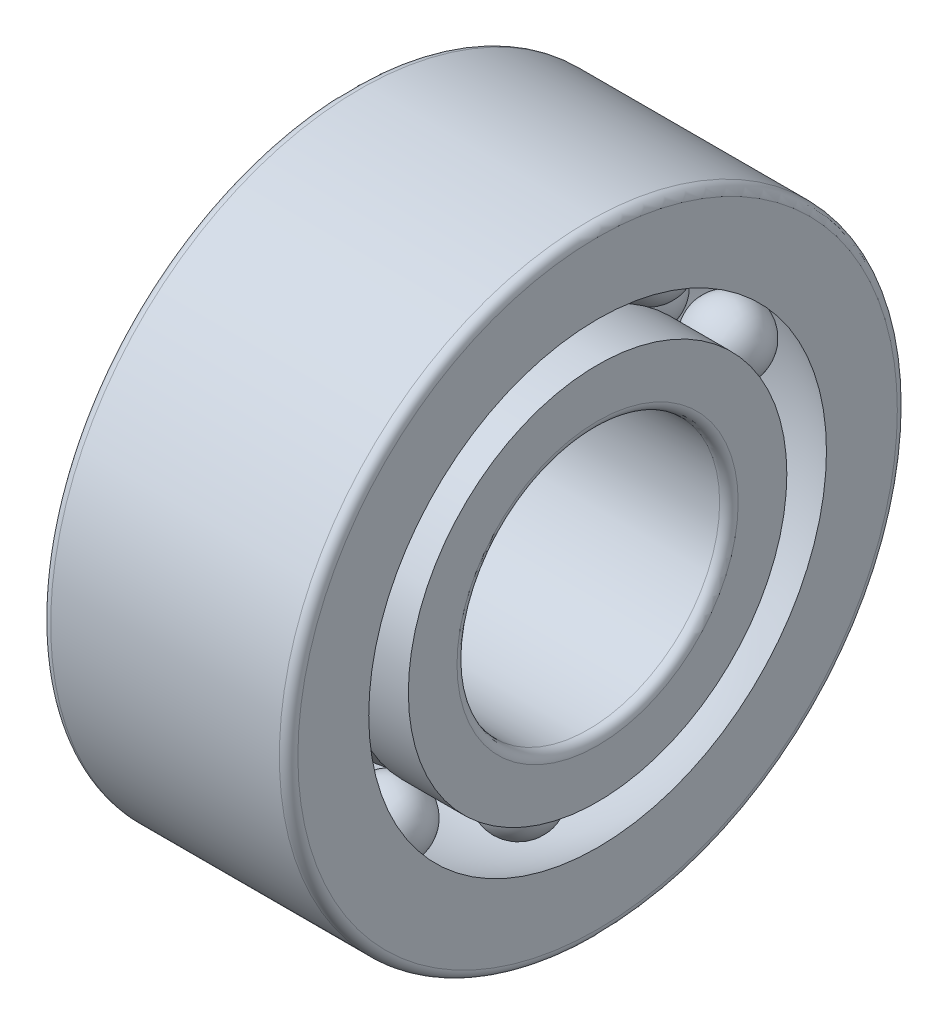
ISO-10303-21;
HEADER;
FILE_DESCRIPTION(('STEP AP214'),'2;1');
FILE_NAME('part.step','',(''),(''),'','','');
FILE_SCHEMA(('AUTOMOTIVE_DESIGN { 1 0 10303 214 1 1 1 1 }'));
ENDSEC;
DATA;
#1=APPLICATION_CONTEXT('core data for automotive mechanical design processes');
#2=APPLICATION_PROTOCOL_DEFINITION('international standard','automotive_design',2000,#1);
#3=PRODUCT_CONTEXT('',#1,'mechanical');
#4=PRODUCT('Part','Part','',(#3));
#5=PRODUCT_RELATED_PRODUCT_CATEGORY('part','',(#4));
#6=PRODUCT_DEFINITION_FORMATION('','',#4);
#7=PRODUCT_DEFINITION_CONTEXT('part definition',#1,'design');
#8=PRODUCT_DEFINITION('design','',#6,#7);
#9=PRODUCT_DEFINITION_SHAPE('','',#8);
#10=(LENGTH_UNIT() NAMED_UNIT(*) SI_UNIT(.MILLI.,.METRE.));
#11=(NAMED_UNIT(*) PLANE_ANGLE_UNIT() SI_UNIT($,.RADIAN.));
#12=(NAMED_UNIT(*) SI_UNIT($,.STERADIAN.) SOLID_ANGLE_UNIT());
#13=UNCERTAINTY_MEASURE_WITH_UNIT(LENGTH_MEASURE(1.E-05),#10,'distance_accuracy_value','');
#14=(GEOMETRIC_REPRESENTATION_CONTEXT(3) GLOBAL_UNCERTAINTY_ASSIGNED_CONTEXT((#13)) GLOBAL_UNIT_ASSIGNED_CONTEXT((#10,
#11,#12)) REPRESENTATION_CONTEXT('',''));
#15=CARTESIAN_POINT('',(0.,0.,0.));
#16=DIRECTION('',(0.,0.,1.));
#17=DIRECTION('',(1.,0.,0.));
#18=AXIS2_PLACEMENT_3D('',#15,#16,#17);
#19=CARTESIAN_POINT('',(10.8666666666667,-11.528492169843,8.37593984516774));
#20=DIRECTION('',(1.,0.,0.));
#21=DIRECTION('',(0.,0.587785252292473,0.809016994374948));
#22=AXIS2_PLACEMENT_3D('',#19,#20,#21);
#23=SPHERICAL_SURFACE('',#22,2.3);
#24=CARTESIAN_POINT('',(8.56666666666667,-11.528492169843,8.37593984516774));
#25=VERTEX_POINT('',#24);
#26=VERTEX_LOOP('',#25);
#27=FACE_BOUND('',#26,.T.);
#28=CARTESIAN_POINT('',(13.1666666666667,-11.528492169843,8.37593984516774));
#29=VERTEX_POINT('',#28);
#30=VERTEX_LOOP('',#29);
#31=FACE_BOUND('',#30,.T.);
#32=ADVANCED_FACE('P0_F15',(#27,#31),#23,.T.);
#33=CLOSED_SHELL('',(#32));
#34=MANIFOLD_SOLID_BREP('P0_B1',#33);
#35=CARTESIAN_POINT('',(8.86632385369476,0.,0.));
#36=DIRECTION('',(1.,0.,0.));
#37=DIRECTION('',(0.,0.,-1.));
#38=AXIS2_PLACEMENT_3D('',#35,#36,#37);
#39=CYLINDRICAL_SURFACE('',#38,12.249);
#40=CARTESIAN_POINT('',(9.73264770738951,0.,0.));
#41=DIRECTION('',(1.,0.,0.));
#42=DIRECTION('',(0.,1.,0.));
#43=AXIS2_PLACEMENT_3D('',#40,#41,#42);
#44=CIRCLE('',#43,12.249);
#45=CARTESIAN_POINT('',(9.73264770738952,12.249,0.));
#46=VERTEX_POINT('',#45);
#47=EDGE_CURVE('P1_E123',#46,#46,#44,.T.);
#48=ORIENTED_EDGE('',*,*,#47,.F.);
#49=EDGE_LOOP('',(#48));
#50=FACE_BOUND('',#49,.T.);
#51=CARTESIAN_POINT('',(6.26735229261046,0.,0.));
#52=DIRECTION('',(-1.,0.,0.));
#53=DIRECTION('',(0.,0.,1.));
#54=AXIS2_PLACEMENT_3D('',#51,#52,#53);
#55=CIRCLE('',#54,12.249);
#56=CARTESIAN_POINT('',(6.26735229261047,0.,12.249));
#57=VERTEX_POINT('',#56);
#58=EDGE_CURVE('P1_E121',#57,#57,#55,.T.);
#59=ORIENTED_EDGE('',*,*,#58,.F.);
#60=EDGE_LOOP('',(#59));
#61=FACE_BOUND('',#60,.T.);
#62=ADVANCED_FACE('P1_F14',(#50,#61),#39,.T.);
#63=CARTESIAN_POINT('',(5.13333333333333,0.,0.));
#64=DIRECTION('',(1.,0.,0.));
#65=DIRECTION('',(0.,0.,-1.));
#66=AXIS2_PLACEMENT_3D('',#63,#64,#65);
#67=TOROIDAL_SURFACE('',#66,14.25,2.3);
#68=ORIENTED_EDGE('',*,*,#58,.T.);
#69=EDGE_LOOP('',(#68));
#70=FACE_BOUND('',#69,.T.);
#71=CARTESIAN_POINT('',(3.9993143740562,0.,0.));
#72=DIRECTION('',(1.,0.,0.));
#73=DIRECTION('',(0.,0.,-1.));
#74=AXIS2_PLACEMENT_3D('',#71,#72,#73);
#75=CIRCLE('',#74,12.249);
#76=CARTESIAN_POINT('',(3.9993143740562,0.,-12.249));
#77=VERTEX_POINT('',#76);
#78=EDGE_CURVE('P1_E126',#77,#77,#75,.F.);
#79=ORIENTED_EDGE('',*,*,#78,.F.);
#80=EDGE_LOOP('',(#79));
#81=FACE_BOUND('',#80,.T.);
#82=ADVANCED_FACE('P1_F90',(#70,#81),#67,.F.);
#83=CARTESIAN_POINT('',(10.8666666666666,0.,0.));
#84=DIRECTION('',(1.,0.,0.));
#85=DIRECTION('',(0.,1.,0.));
#86=AXIS2_PLACEMENT_3D('',#83,#84,#85);
#87=TOROIDAL_SURFACE('',#86,14.25,2.3);
#88=ORIENTED_EDGE('',*,*,#47,.T.);
#89=EDGE_LOOP('',(#88));
#90=FACE_BOUND('',#89,.T.);
#91=CARTESIAN_POINT('',(12.0006856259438,0.,0.));
#92=DIRECTION('',(1.,0.,0.));
#93=DIRECTION('',(0.,0.,-1.));
#94=AXIS2_PLACEMENT_3D('',#91,#92,#93);
#95=CIRCLE('',#94,12.249);
#96=CARTESIAN_POINT('',(12.0006856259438,0.,-12.249));
#97=VERTEX_POINT('',#96);
#98=EDGE_CURVE('P1_E119',#97,#97,#95,.T.);
#99=ORIENTED_EDGE('',*,*,#98,.F.);
#100=EDGE_LOOP('',(#99));
#101=FACE_BOUND('',#100,.T.);
#102=ADVANCED_FACE('P1_F16',(#90,#101),#87,.F.);
#103=CARTESIAN_POINT('',(1.9996571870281,0.,0.));
#104=DIRECTION('',(1.,0.,0.));
#105=DIRECTION('',(0.,0.,-1.));
#106=AXIS2_PLACEMENT_3D('',#103,#104,#105);
#107=CYLINDRICAL_SURFACE('',#106,12.249);
#108=CARTESIAN_POINT('',(0.,0.,0.));
#109=DIRECTION('',(1.,0.,0.));
#110=DIRECTION('',(0.,0.,-1.));
#111=AXIS2_PLACEMENT_3D('',#108,#109,#110);
#112=CIRCLE('',#111,12.249);
#113=CARTESIAN_POINT('',(0.,0.,-12.249));
#114=VERTEX_POINT('',#113);
#115=EDGE_CURVE('P1_E18',#114,#114,#112,.F.);
#116=ORIENTED_EDGE('',*,*,#115,.F.);
#117=EDGE_LOOP('',(#116));
#118=FACE_BOUND('',#117,.T.);
#119=ORIENTED_EDGE('',*,*,#78,.T.);
#120=EDGE_LOOP('',(#119));
#121=FACE_BOUND('',#120,.T.);
#122=ADVANCED_FACE('P1_F84',(#118,#121),#107,.T.);
#123=CARTESIAN_POINT('',(14.0003428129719,0.,0.));
#124=DIRECTION('',(1.,0.,0.));
#125=DIRECTION('',(0.,0.,-1.));
#126=AXIS2_PLACEMENT_3D('',#123,#124,#125);
#127=CYLINDRICAL_SURFACE('',#126,12.249);
#128=ORIENTED_EDGE('',*,*,#98,.T.);
#129=EDGE_LOOP('',(#128));
#130=FACE_BOUND('',#129,.T.);
#131=CARTESIAN_POINT('',(16.,0.,0.));
#132=DIRECTION('',(1.,0.,0.));
#133=DIRECTION('',(0.,0.,-1.));
#134=AXIS2_PLACEMENT_3D('',#131,#132,#133);
#135=CIRCLE('',#134,12.249);
#136=CARTESIAN_POINT('',(16.,0.,-12.249));
#137=VERTEX_POINT('',#136);
#138=EDGE_CURVE('P1_E114',#137,#137,#135,.T.);
#139=ORIENTED_EDGE('',*,*,#138,.F.);
#140=EDGE_LOOP('',(#139));
#141=FACE_BOUND('',#140,.T.);
#142=ADVANCED_FACE('P1_F80',(#130,#141),#127,.T.);
#143=CARTESIAN_POINT('',(0.,10.3745,0.));
#144=DIRECTION('',(-1.,0.,0.));
#145=DIRECTION('',(0.,0.,1.));
#146=AXIS2_PLACEMENT_3D('',#143,#144,#145);
#147=PLANE('',#146);
#148=CARTESIAN_POINT('',(0.,0.,0.));
#149=DIRECTION('',(-1.,0.,0.));
#150=DIRECTION('',(0.,1.,0.));
#151=AXIS2_PLACEMENT_3D('',#148,#149,#150);
#152=CIRCLE('',#151,9.1);
#153=CARTESIAN_POINT('',(0.,9.1,0.));
#154=VERTEX_POINT('',#153);
#155=EDGE_CURVE('P1_E64',#154,#154,#152,.T.);
#156=ORIENTED_EDGE('',*,*,#155,.F.);
#157=EDGE_LOOP('',(#156));
#158=FACE_BOUND('',#157,.T.);
#159=ORIENTED_EDGE('',*,*,#115,.T.);
#160=EDGE_LOOP('',(#159));
#161=FACE_BOUND('',#160,.T.);
#162=ADVANCED_FACE('P1_F70',(#158,#161),#147,.T.);
#163=CARTESIAN_POINT('',(16.,10.3745,0.));
#164=DIRECTION('',(1.,0.,0.));
#165=DIRECTION('',(0.,0.,-1.));
#166=AXIS2_PLACEMENT_3D('',#163,#164,#165);
#167=PLANE('',#166);
#168=CARTESIAN_POINT('',(16.,0.,0.));
#169=DIRECTION('',(1.,0.,0.));
#170=DIRECTION('',(0.,1.,0.));
#171=AXIS2_PLACEMENT_3D('',#168,#169,#170);
#172=CIRCLE('',#171,9.1);
#173=CARTESIAN_POINT('',(16.,9.1,0.));
#174=VERTEX_POINT('',#173);
#175=EDGE_CURVE('P1_E27',#174,#174,#172,.T.);
#176=ORIENTED_EDGE('',*,*,#175,.F.);
#177=EDGE_LOOP('',(#176));
#178=FACE_BOUND('',#177,.T.);
#179=ORIENTED_EDGE('',*,*,#138,.T.);
#180=EDGE_LOOP('',(#179));
#181=FACE_BOUND('',#180,.T.);
#182=ADVANCED_FACE('P1_F79',(#178,#181),#167,.T.);
#183=CARTESIAN_POINT('',(0.599999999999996,0.,0.));
#184=DIRECTION('',(1.,0.,0.));
#185=DIRECTION('',(0.,0.,-1.));
#186=AXIS2_PLACEMENT_3D('',#183,#184,#185);
#187=TOROIDAL_SURFACE('',#186,9.1,0.6);
#188=ORIENTED_EDGE('',*,*,#155,.T.);
#189=EDGE_LOOP('',(#188));
#190=FACE_BOUND('',#189,.T.);
#191=CARTESIAN_POINT('',(0.599999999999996,0.,0.));
#192=DIRECTION('',(1.,0.,0.));
#193=DIRECTION('',(0.,0.,-1.));
#194=AXIS2_PLACEMENT_3D('',#191,#192,#193);
#195=CIRCLE('',#194,8.5);
#196=CARTESIAN_POINT('',(0.599999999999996,0.,-8.5));
#197=VERTEX_POINT('',#196);
#198=EDGE_CURVE('P1_E22',#197,#197,#195,.T.);
#199=ORIENTED_EDGE('',*,*,#198,.T.);
#200=EDGE_LOOP('',(#199));
#201=FACE_BOUND('',#200,.T.);
#202=ADVANCED_FACE('P1_F45',(#190,#201),#187,.T.);
#203=CARTESIAN_POINT('',(15.4,0.,0.));
#204=DIRECTION('',(1.,0.,0.));
#205=DIRECTION('',(0.,0.,-1.));
#206=AXIS2_PLACEMENT_3D('',#203,#204,#205);
#207=TOROIDAL_SURFACE('',#206,9.1,0.6);
#208=CARTESIAN_POINT('',(15.4,0.,0.));
#209=DIRECTION('',(1.,0.,0.));
#210=DIRECTION('',(0.,0.,-1.));
#211=AXIS2_PLACEMENT_3D('',#208,#209,#210);
#212=CIRCLE('',#211,8.5);
#213=CARTESIAN_POINT('',(15.4,0.,-8.5));
#214=VERTEX_POINT('',#213);
#215=EDGE_CURVE('P1_E10',#214,#214,#212,.F.);
#216=ORIENTED_EDGE('',*,*,#215,.T.);
#217=EDGE_LOOP('',(#216));
#218=FACE_BOUND('',#217,.T.);
#219=ORIENTED_EDGE('',*,*,#175,.T.);
#220=EDGE_LOOP('',(#219));
#221=FACE_BOUND('',#220,.T.);
#222=ADVANCED_FACE('P1_F39',(#218,#221),#207,.T.);
#223=CARTESIAN_POINT('',(12.,0.,0.));
#224=DIRECTION('',(1.,0.,0.));
#225=DIRECTION('',(0.,0.,-1.));
#226=AXIS2_PLACEMENT_3D('',#223,#224,#225);
#227=CYLINDRICAL_SURFACE('',#226,8.5);
#228=ORIENTED_EDGE('',*,*,#215,.F.);
#229=EDGE_LOOP('',(#228));
#230=FACE_BOUND('',#229,.T.);
#231=ORIENTED_EDGE('',*,*,#198,.F.);
#232=EDGE_LOOP('',(#231));
#233=FACE_BOUND('',#232,.T.);
#234=ADVANCED_FACE('P1_F44',(#230,#233),#227,.F.);
#235=CLOSED_SHELL('',(#62,#82,#102,#122,#142,#162,#182,#202,#222,#234));
#236=MANIFOLD_SOLID_BREP('P1_B1',#235);
#237=CARTESIAN_POINT('',(10.8666666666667,14.25,0.));
#238=DIRECTION('',(1.,0.,0.));
#239=DIRECTION('',(0.,0.,-1.));
#240=AXIS2_PLACEMENT_3D('',#237,#238,#239);
#241=SPHERICAL_SURFACE('',#240,2.3);
#242=CARTESIAN_POINT('',(8.56666666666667,14.25,0.));
#243=VERTEX_POINT('',#242);
#244=VERTEX_LOOP('',#243);
#245=FACE_BOUND('',#244,.T.);
#246=CARTESIAN_POINT('',(13.1666666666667,14.25,0.));
#247=VERTEX_POINT('',#246);
#248=VERTEX_LOOP('',#247);
#249=FACE_BOUND('',#248,.T.);
#250=ADVANCED_FACE('P2_F15',(#245,#249),#241,.T.);
#251=CLOSED_SHELL('',(#250));
#252=MANIFOLD_SOLID_BREP('P2_B1',#251);
#253=CARTESIAN_POINT('',(8.,0.,0.));
#254=DIRECTION('',(0.,0.,1.));
#255=DIRECTION('',(1.,0.,0.));
#256=AXIS2_PLACEMENT_3D('',#253,#254,#255);
#257=SPHERICAL_SURFACE('',#256,16.8354834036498);
#258=CARTESIAN_POINT('',(8.,0.,0.));
#259=DIRECTION('',(1.,0.,0.));
#260=DIRECTION('',(0.,0.,-1.));
#261=AXIS2_PLACEMENT_3D('',#258,#259,#260);
#262=SPHERICAL_SURFACE('',#261,16.8354834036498);
#263=CARTESIAN_POINT('',(16.,0.,0.));
#264=DIRECTION('',(1.,0.,0.));
#265=DIRECTION('',(0.,0.,-1.));
#266=AXIS2_PLACEMENT_3D('',#263,#264,#265);
#267=CIRCLE('',#266,14.8132880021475);
#268=CARTESIAN_POINT('',(16.,0.,-14.8132880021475));
#269=VERTEX_POINT('',#268);
#270=EDGE_CURVE('P3_E91',#269,#269,#267,.F.);
#271=ORIENTED_EDGE('',*,*,#270,.F.);
#272=EDGE_LOOP('',(#271));
#273=FACE_BOUND('',#272,.T.);
#274=CARTESIAN_POINT('',(0.,0.,0.));
#275=DIRECTION('',(-1.,0.,0.));
#276=DIRECTION('',(0.,0.,1.));
#277=AXIS2_PLACEMENT_3D('',#274,#275,#276);
#278=CIRCLE('',#277,14.8132880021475);
#279=CARTESIAN_POINT('',(0.,0.,14.8132880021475));
#280=VERTEX_POINT('',#279);
#281=EDGE_CURVE('P3_E17',#280,#280,#278,.F.);
#282=ORIENTED_EDGE('',*,*,#281,.F.);
#283=EDGE_LOOP('',(#282));
#284=FACE_BOUND('',#283,.T.);
#285=ADVANCED_FACE('P3_F14',(#273,#284),#262,.F.);
#286=CARTESIAN_POINT('',(0.,17.4066440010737,0.));
#287=DIRECTION('',(-1.,0.,0.));
#288=DIRECTION('',(0.,0.,1.));
#289=AXIS2_PLACEMENT_3D('',#286,#287,#288);
#290=PLANE('',#289);
#291=ORIENTED_EDGE('',*,*,#281,.T.);
#292=EDGE_LOOP('',(#291));
#293=FACE_BOUND('',#292,.T.);
#294=CARTESIAN_POINT('',(0.,0.,0.));
#295=DIRECTION('',(1.,0.,0.));
#296=DIRECTION('',(0.,1.,0.));
#297=AXIS2_PLACEMENT_3D('',#294,#295,#296);
#298=CIRCLE('',#297,19.4);
#299=CARTESIAN_POINT('',(0.,19.4,0.));
#300=VERTEX_POINT('',#299);
#301=EDGE_CURVE('P3_E64',#300,#300,#298,.T.);
#302=ORIENTED_EDGE('',*,*,#301,.F.);
#303=EDGE_LOOP('',(#302));
#304=FACE_BOUND('',#303,.T.);
#305=ADVANCED_FACE('P3_F69',(#293,#304),#290,.T.);
#306=CARTESIAN_POINT('',(16.,17.4066440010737,0.));
#307=DIRECTION('',(1.,0.,0.));
#308=DIRECTION('',(0.,0.,-1.));
#309=AXIS2_PLACEMENT_3D('',#306,#307,#308);
#310=PLANE('',#309);
#311=ORIENTED_EDGE('',*,*,#270,.T.);
#312=EDGE_LOOP('',(#311));
#313=FACE_BOUND('',#312,.T.);
#314=CARTESIAN_POINT('',(16.,0.,0.));
#315=DIRECTION('',(-1.,0.,0.));
#316=DIRECTION('',(0.,1.,0.));
#317=AXIS2_PLACEMENT_3D('',#314,#315,#316);
#318=CIRCLE('',#317,19.4);
#319=CARTESIAN_POINT('',(16.,19.4,0.));
#320=VERTEX_POINT('',#319);
#321=EDGE_CURVE('P3_E26',#320,#320,#318,.T.);
#322=ORIENTED_EDGE('',*,*,#321,.F.);
#323=EDGE_LOOP('',(#322));
#324=FACE_BOUND('',#323,.T.);
#325=ADVANCED_FACE('P3_F77',(#313,#324),#310,.T.);
#326=CARTESIAN_POINT('',(0.599999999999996,0.,0.));
#327=DIRECTION('',(1.,0.,0.));
#328=DIRECTION('',(0.,0.,-1.));
#329=AXIS2_PLACEMENT_3D('',#326,#327,#328);
#330=TOROIDAL_SURFACE('',#329,19.4,0.6);
#331=CARTESIAN_POINT('',(0.599999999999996,0.,0.));
#332=DIRECTION('',(1.,0.,0.));
#333=DIRECTION('',(0.,0.,-1.));
#334=AXIS2_PLACEMENT_3D('',#331,#332,#333);
#335=CIRCLE('',#334,20.);
#336=CARTESIAN_POINT('',(0.599999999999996,0.,-20.));
#337=VERTEX_POINT('',#336);
#338=EDGE_CURVE('P3_E21',#337,#337,#335,.T.);
#339=ORIENTED_EDGE('',*,*,#338,.F.);
#340=EDGE_LOOP('',(#339));
#341=FACE_BOUND('',#340,.T.);
#342=ORIENTED_EDGE('',*,*,#301,.T.);
#343=EDGE_LOOP('',(#342));
#344=FACE_BOUND('',#343,.T.);
#345=ADVANCED_FACE('P3_F44',(#341,#344),#330,.T.);
#346=CARTESIAN_POINT('',(15.4,0.,0.));
#347=DIRECTION('',(1.,0.,0.));
#348=DIRECTION('',(0.,0.,-1.));
#349=AXIS2_PLACEMENT_3D('',#346,#347,#348);
#350=TOROIDAL_SURFACE('',#349,19.4,0.6);
#351=ORIENTED_EDGE('',*,*,#321,.T.);
#352=EDGE_LOOP('',(#351));
#353=FACE_BOUND('',#352,.T.);
#354=CARTESIAN_POINT('',(15.4,0.,0.));
#355=DIRECTION('',(1.,0.,0.));
#356=DIRECTION('',(0.,0.,-1.));
#357=AXIS2_PLACEMENT_3D('',#354,#355,#356);
#358=CIRCLE('',#357,20.);
#359=CARTESIAN_POINT('',(15.4,0.,-20.));
#360=VERTEX_POINT('',#359);
#361=EDGE_CURVE('P3_E10',#360,#360,#358,.F.);
#362=ORIENTED_EDGE('',*,*,#361,.F.);
#363=EDGE_LOOP('',(#362));
#364=FACE_BOUND('',#363,.T.);
#365=ADVANCED_FACE('P3_F38',(#353,#364),#350,.T.);
#366=CARTESIAN_POINT('',(12.,0.,0.));
#367=DIRECTION('',(1.,0.,0.));
#368=DIRECTION('',(0.,0.,-1.));
#369=AXIS2_PLACEMENT_3D('',#366,#367,#368);
#370=CYLINDRICAL_SURFACE('',#369,20.);
#371=ORIENTED_EDGE('',*,*,#361,.T.);
#372=EDGE_LOOP('',(#371));
#373=FACE_BOUND('',#372,.T.);
#374=ORIENTED_EDGE('',*,*,#338,.T.);
#375=EDGE_LOOP('',(#374));
#376=FACE_BOUND('',#375,.T.);
#377=ADVANCED_FACE('P3_F43',(#373,#376),#370,.T.);
#378=CLOSED_SHELL('',(#285,#305,#325,#345,#365,#377));
#379=MANIFOLD_SOLID_BREP('P3_B1',#378);
#380=CARTESIAN_POINT('',(5.13333333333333,14.25,0.));
#381=DIRECTION('',(1.,0.,0.));
#382=DIRECTION('',(0.,0.,-1.));
#383=AXIS2_PLACEMENT_3D('',#380,#381,#382);
#384=SPHERICAL_SURFACE('',#383,2.3);
#385=CARTESIAN_POINT('',(2.83333333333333,14.25,0.));
#386=VERTEX_POINT('',#385);
#387=VERTEX_LOOP('',#386);
#388=FACE_BOUND('',#387,.T.);
#389=CARTESIAN_POINT('',(7.43333333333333,14.25,0.));
#390=VERTEX_POINT('',#389);
#391=VERTEX_LOOP('',#390);
#392=FACE_BOUND('',#391,.T.);
#393=ADVANCED_FACE('P4_F15',(#388,#392),#384,.T.);
#394=CLOSED_SHELL('',(#393));
#395=MANIFOLD_SOLID_BREP('P4_B1',#394);
#396=CARTESIAN_POINT('',(10.8666666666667,-4.403492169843,13.5525553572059));
#397=DIRECTION('',(1.,0.,0.));
#398=DIRECTION('',(0.,0.951056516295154,0.309016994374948));
#399=AXIS2_PLACEMENT_3D('',#396,#397,#398);
#400=SPHERICAL_SURFACE('',#399,2.3);
#401=CARTESIAN_POINT('',(8.56666666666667,-4.403492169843,13.5525553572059));
#402=VERTEX_POINT('',#401);
#403=VERTEX_LOOP('',#402);
#404=FACE_BOUND('',#403,.T.);
#405=CARTESIAN_POINT('',(13.1666666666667,-4.403492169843,13.5525553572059));
#406=VERTEX_POINT('',#405);
#407=VERTEX_LOOP('',#406);
#408=FACE_BOUND('',#407,.T.);
#409=ADVANCED_FACE('P5_F15',(#404,#408),#400,.T.);
#410=CLOSED_SHELL('',(#409));
#411=MANIFOLD_SOLID_BREP('P5_B1',#410);
#412=CARTESIAN_POINT('',(5.13333333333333,4.403492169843,-13.5525553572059));
#413=DIRECTION('',(1.,0.,0.));
#414=DIRECTION('',(0.,-0.951056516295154,-0.309016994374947));
#415=AXIS2_PLACEMENT_3D('',#412,#413,#414);
#416=SPHERICAL_SURFACE('',#415,2.3);
#417=CARTESIAN_POINT('',(2.83333333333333,4.403492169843,-13.5525553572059));
#418=VERTEX_POINT('',#417);
#419=VERTEX_LOOP('',#418);
#420=FACE_BOUND('',#419,.T.);
#421=CARTESIAN_POINT('',(7.43333333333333,4.403492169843,-13.5525553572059));
#422=VERTEX_POINT('',#421);
#423=VERTEX_LOOP('',#422);
#424=FACE_BOUND('',#423,.T.);
#425=ADVANCED_FACE('P6_F15',(#420,#424),#416,.T.);
#426=CLOSED_SHELL('',(#425));
#427=MANIFOLD_SOLID_BREP('P6_B1',#426);
#428=CARTESIAN_POINT('',(10.8666666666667,4.403492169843,-13.5525553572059));
#429=DIRECTION('',(1.,0.,0.));
#430=DIRECTION('',(0.,-0.951056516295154,-0.309016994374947));
#431=AXIS2_PLACEMENT_3D('',#428,#429,#430);
#432=SPHERICAL_SURFACE('',#431,2.3);
#433=CARTESIAN_POINT('',(8.56666666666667,4.403492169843,-13.5525553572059));
#434=VERTEX_POINT('',#433);
#435=VERTEX_LOOP('',#434);
#436=FACE_BOUND('',#435,.T.);
#437=CARTESIAN_POINT('',(13.1666666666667,4.403492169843,-13.5525553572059));
#438=VERTEX_POINT('',#437);
#439=VERTEX_LOOP('',#438);
#440=FACE_BOUND('',#439,.T.);
#441=ADVANCED_FACE('P7_F15',(#436,#440),#432,.T.);
#442=CLOSED_SHELL('',(#441));
#443=MANIFOLD_SOLID_BREP('P7_B1',#442);
#444=CARTESIAN_POINT('',(5.13333333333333,11.528492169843,-8.37593984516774));
#445=DIRECTION('',(1.,0.,0.));
#446=DIRECTION('',(0.,-0.587785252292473,-0.809016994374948));
#447=AXIS2_PLACEMENT_3D('',#444,#445,#446);
#448=SPHERICAL_SURFACE('',#447,2.3);
#449=CARTESIAN_POINT('',(2.83333333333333,11.528492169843,-8.37593984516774));
#450=VERTEX_POINT('',#449);
#451=VERTEX_LOOP('',#450);
#452=FACE_BOUND('',#451,.T.);
#453=CARTESIAN_POINT('',(7.43333333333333,11.528492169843,-8.37593984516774));
#454=VERTEX_POINT('',#453);
#455=VERTEX_LOOP('',#454);
#456=FACE_BOUND('',#455,.T.);
#457=ADVANCED_FACE('P8_F15',(#452,#456),#448,.T.);
#458=CLOSED_SHELL('',(#457));
#459=MANIFOLD_SOLID_BREP('P8_B1',#458);
#460=CARTESIAN_POINT('',(10.8666666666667,-11.528492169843,-8.37593984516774));
#461=DIRECTION('',(1.,0.,0.));
#462=DIRECTION('',(0.,-0.587785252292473,0.809016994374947));
#463=AXIS2_PLACEMENT_3D('',#460,#461,#462);
#464=SPHERICAL_SURFACE('',#463,2.3);
#465=CARTESIAN_POINT('',(8.56666666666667,-11.528492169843,-8.37593984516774));
#466=VERTEX_POINT('',#465);
#467=VERTEX_LOOP('',#466);
#468=FACE_BOUND('',#467,.T.);
#469=CARTESIAN_POINT('',(13.1666666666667,-11.528492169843,-8.37593984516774));
#470=VERTEX_POINT('',#469);
#471=VERTEX_LOOP('',#470);
#472=FACE_BOUND('',#471,.T.);
#473=ADVANCED_FACE('P9_F15',(#468,#472),#464,.T.);
#474=CLOSED_SHELL('',(#473));
#475=MANIFOLD_SOLID_BREP('P9_B1',#474);
#476=CARTESIAN_POINT('',(10.8666666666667,-14.25,0.));
#477=DIRECTION('',(1.,0.,0.));
#478=DIRECTION('',(0.,0.,1.));
#479=AXIS2_PLACEMENT_3D('',#476,#477,#478);
#480=SPHERICAL_SURFACE('',#479,2.3);
#481=CARTESIAN_POINT('',(8.56666666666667,-14.25,0.));
#482=VERTEX_POINT('',#481);
#483=VERTEX_LOOP('',#482);
#484=FACE_BOUND('',#483,.T.);
#485=CARTESIAN_POINT('',(13.1666666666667,-14.25,0.));
#486=VERTEX_POINT('',#485);
#487=VERTEX_LOOP('',#486);
#488=FACE_BOUND('',#487,.T.);
#489=ADVANCED_FACE('P10_F15',(#484,#488),#480,.T.);
#490=CLOSED_SHELL('',(#489));
#491=MANIFOLD_SOLID_BREP('P10_B1',#490);
#492=CARTESIAN_POINT('',(5.13333333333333,-4.403492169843,-13.5525553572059));
#493=DIRECTION('',(1.,0.,0.));
#494=DIRECTION('',(0.,-0.951056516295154,0.309016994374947));
#495=AXIS2_PLACEMENT_3D('',#492,#493,#494);
#496=SPHERICAL_SURFACE('',#495,2.3);
#497=CARTESIAN_POINT('',(2.83333333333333,-4.403492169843,-13.5525553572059));
#498=VERTEX_POINT('',#497);
#499=VERTEX_LOOP('',#498);
#500=FACE_BOUND('',#499,.T.);
#501=CARTESIAN_POINT('',(7.43333333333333,-4.403492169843,-13.5525553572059));
#502=VERTEX_POINT('',#501);
#503=VERTEX_LOOP('',#502);
#504=FACE_BOUND('',#503,.T.);
#505=ADVANCED_FACE('P11_F15',(#500,#504),#496,.T.);
#506=CLOSED_SHELL('',(#505));
#507=MANIFOLD_SOLID_BREP('P11_B1',#506);
#508=CARTESIAN_POINT('',(5.13333333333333,-11.528492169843,8.37593984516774));
#509=DIRECTION('',(1.,0.,0.));
#510=DIRECTION('',(0.,0.587785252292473,0.809016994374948));
#511=AXIS2_PLACEMENT_3D('',#508,#509,#510);
#512=SPHERICAL_SURFACE('',#511,2.3);
#513=CARTESIAN_POINT('',(2.83333333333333,-11.528492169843,8.37593984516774));
#514=VERTEX_POINT('',#513);
#515=VERTEX_LOOP('',#514);
#516=FACE_BOUND('',#515,.T.);
#517=CARTESIAN_POINT('',(7.43333333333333,-11.528492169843,8.37593984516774));
#518=VERTEX_POINT('',#517);
#519=VERTEX_LOOP('',#518);
#520=FACE_BOUND('',#519,.T.);
#521=ADVANCED_FACE('P12_F15',(#516,#520),#512,.T.);
#522=CLOSED_SHELL('',(#521));
#523=MANIFOLD_SOLID_BREP('P12_B1',#522);
#524=CARTESIAN_POINT('',(5.13333333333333,4.403492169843,13.5525553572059));
#525=DIRECTION('',(1.,0.,0.));
#526=DIRECTION('',(0.,0.951056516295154,-0.309016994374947));
#527=AXIS2_PLACEMENT_3D('',#524,#525,#526);
#528=SPHERICAL_SURFACE('',#527,2.3);
#529=CARTESIAN_POINT('',(2.83333333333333,4.403492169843,13.5525553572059));
#530=VERTEX_POINT('',#529);
#531=VERTEX_LOOP('',#530);
#532=FACE_BOUND('',#531,.T.);
#533=CARTESIAN_POINT('',(7.43333333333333,4.403492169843,13.5525553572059));
#534=VERTEX_POINT('',#533);
#535=VERTEX_LOOP('',#534);
#536=FACE_BOUND('',#535,.T.);
#537=ADVANCED_FACE('P13_F15',(#532,#536),#528,.T.);
#538=CLOSED_SHELL('',(#537));
#539=MANIFOLD_SOLID_BREP('P13_B1',#538);
#540=CARTESIAN_POINT('',(5.13333333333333,-4.403492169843,13.5525553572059));
#541=DIRECTION('',(1.,0.,0.));
#542=DIRECTION('',(0.,0.951056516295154,0.309016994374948));
#543=AXIS2_PLACEMENT_3D('',#540,#541,#542);
#544=SPHERICAL_SURFACE('',#543,2.3);
#545=CARTESIAN_POINT('',(2.83333333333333,-4.403492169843,13.5525553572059));
#546=VERTEX_POINT('',#545);
#547=VERTEX_LOOP('',#546);
#548=FACE_BOUND('',#547,.T.);
#549=CARTESIAN_POINT('',(7.43333333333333,-4.403492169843,13.5525553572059));
#550=VERTEX_POINT('',#549);
#551=VERTEX_LOOP('',#550);
#552=FACE_BOUND('',#551,.T.);
#553=ADVANCED_FACE('P14_F15',(#548,#552),#544,.T.);
#554=CLOSED_SHELL('',(#553));
#555=MANIFOLD_SOLID_BREP('P14_B1',#554);
#556=CARTESIAN_POINT('',(10.8666666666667,11.528492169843,8.37593984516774));
#557=DIRECTION('',(1.,0.,0.));
#558=DIRECTION('',(0.,0.587785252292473,-0.809016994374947));
#559=AXIS2_PLACEMENT_3D('',#556,#557,#558);
#560=SPHERICAL_SURFACE('',#559,2.3);
#561=CARTESIAN_POINT('',(8.56666666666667,11.528492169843,8.37593984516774));
#562=VERTEX_POINT('',#561);
#563=VERTEX_LOOP('',#562);
#564=FACE_BOUND('',#563,.T.);
#565=CARTESIAN_POINT('',(13.1666666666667,11.528492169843,8.37593984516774));
#566=VERTEX_POINT('',#565);
#567=VERTEX_LOOP('',#566);
#568=FACE_BOUND('',#567,.T.);
#569=ADVANCED_FACE('P15_F15',(#564,#568),#560,.T.);
#570=CLOSED_SHELL('',(#569));
#571=MANIFOLD_SOLID_BREP('P15_B1',#570);
#572=CARTESIAN_POINT('',(10.8666666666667,4.403492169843,13.5525553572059));
#573=DIRECTION('',(1.,0.,0.));
#574=DIRECTION('',(0.,0.951056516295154,-0.309016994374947));
#575=AXIS2_PLACEMENT_3D('',#572,#573,#574);
#576=SPHERICAL_SURFACE('',#575,2.3);
#577=CARTESIAN_POINT('',(8.56666666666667,4.403492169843,13.5525553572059));
#578=VERTEX_POINT('',#577);
#579=VERTEX_LOOP('',#578);
#580=FACE_BOUND('',#579,.T.);
#581=CARTESIAN_POINT('',(13.1666666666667,4.403492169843,13.5525553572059));
#582=VERTEX_POINT('',#581);
#583=VERTEX_LOOP('',#582);
#584=FACE_BOUND('',#583,.T.);
#585=ADVANCED_FACE('P16_F15',(#580,#584),#576,.T.);
#586=CLOSED_SHELL('',(#585));
#587=MANIFOLD_SOLID_BREP('P16_B1',#586);
#588=CARTESIAN_POINT('',(10.8666666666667,-4.403492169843,-13.5525553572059));
#589=DIRECTION('',(1.,0.,0.));
#590=DIRECTION('',(0.,-0.951056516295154,0.309016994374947));
#591=AXIS2_PLACEMENT_3D('',#588,#589,#590);
#592=SPHERICAL_SURFACE('',#591,2.3);
#593=CARTESIAN_POINT('',(8.56666666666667,-4.403492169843,-13.5525553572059));
#594=VERTEX_POINT('',#593);
#595=VERTEX_LOOP('',#594);
#596=FACE_BOUND('',#595,.T.);
#597=CARTESIAN_POINT('',(13.1666666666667,-4.403492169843,-13.5525553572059));
#598=VERTEX_POINT('',#597);
#599=VERTEX_LOOP('',#598);
#600=FACE_BOUND('',#599,.T.);
#601=ADVANCED_FACE('P17_F15',(#596,#600),#592,.T.);
#602=CLOSED_SHELL('',(#601));
#603=MANIFOLD_SOLID_BREP('P17_B1',#602);
#604=CARTESIAN_POINT('',(5.13333333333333,-14.25,0.));
#605=DIRECTION('',(1.,0.,0.));
#606=DIRECTION('',(0.,0.,1.));
#607=AXIS2_PLACEMENT_3D('',#604,#605,#606);
#608=SPHERICAL_SURFACE('',#607,2.3);
#609=CARTESIAN_POINT('',(2.83333333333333,-14.25,0.));
#610=VERTEX_POINT('',#609);
#611=VERTEX_LOOP('',#610);
#612=FACE_BOUND('',#611,.T.);
#613=CARTESIAN_POINT('',(7.43333333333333,-14.25,0.));
#614=VERTEX_POINT('',#613);
#615=VERTEX_LOOP('',#614);
#616=FACE_BOUND('',#615,.T.);
#617=ADVANCED_FACE('P18_F15',(#612,#616),#608,.T.);
#618=CLOSED_SHELL('',(#617));
#619=MANIFOLD_SOLID_BREP('P18_B1',#618);
#620=CARTESIAN_POINT('',(5.13333333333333,-11.528492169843,-8.37593984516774));
#621=DIRECTION('',(1.,0.,0.));
#622=DIRECTION('',(0.,-0.587785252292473,0.809016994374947));
#623=AXIS2_PLACEMENT_3D('',#620,#621,#622);
#624=SPHERICAL_SURFACE('',#623,2.3);
#625=CARTESIAN_POINT('',(2.83333333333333,-11.528492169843,-8.37593984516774));
#626=VERTEX_POINT('',#625);
#627=VERTEX_LOOP('',#626);
#628=FACE_BOUND('',#627,.T.);
#629=CARTESIAN_POINT('',(7.43333333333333,-11.528492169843,-8.37593984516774));
#630=VERTEX_POINT('',#629);
#631=VERTEX_LOOP('',#630);
#632=FACE_BOUND('',#631,.T.);
#633=ADVANCED_FACE('P19_F15',(#628,#632),#624,.T.);
#634=CLOSED_SHELL('',(#633));
#635=MANIFOLD_SOLID_BREP('P19_B1',#634);
#636=CARTESIAN_POINT('',(10.8666666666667,11.528492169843,-8.37593984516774));
#637=DIRECTION('',(1.,0.,0.));
#638=DIRECTION('',(0.,-0.587785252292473,-0.809016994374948));
#639=AXIS2_PLACEMENT_3D('',#636,#637,#638);
#640=SPHERICAL_SURFACE('',#639,2.3);
#641=CARTESIAN_POINT('',(8.56666666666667,11.528492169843,-8.37593984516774));
#642=VERTEX_POINT('',#641);
#643=VERTEX_LOOP('',#642);
#644=FACE_BOUND('',#643,.T.);
#645=CARTESIAN_POINT('',(13.1666666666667,11.528492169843,-8.37593984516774));
#646=VERTEX_POINT('',#645);
#647=VERTEX_LOOP('',#646);
#648=FACE_BOUND('',#647,.T.);
#649=ADVANCED_FACE('P20_F15',(#644,#648),#640,.T.);
#650=CLOSED_SHELL('',(#649));
#651=MANIFOLD_SOLID_BREP('P20_B1',#650);
#652=CARTESIAN_POINT('',(5.13333333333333,11.528492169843,8.37593984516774));
#653=DIRECTION('',(1.,0.,0.));
#654=DIRECTION('',(0.,0.587785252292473,-0.809016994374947));
#655=AXIS2_PLACEMENT_3D('',#652,#653,#654);
#656=SPHERICAL_SURFACE('',#655,2.3);
#657=CARTESIAN_POINT('',(2.83333333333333,11.528492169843,8.37593984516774));
#658=VERTEX_POINT('',#657);
#659=VERTEX_LOOP('',#658);
#660=FACE_BOUND('',#659,.T.);
#661=CARTESIAN_POINT('',(7.43333333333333,11.528492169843,8.37593984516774));
#662=VERTEX_POINT('',#661);
#663=VERTEX_LOOP('',#662);
#664=FACE_BOUND('',#663,.T.);
#665=ADVANCED_FACE('P21_F15',(#660,#664),#656,.T.);
#666=CLOSED_SHELL('',(#665));
#667=MANIFOLD_SOLID_BREP('P21_B1',#666);
#668=ADVANCED_BREP_SHAPE_REPRESENTATION('',(#18,#34,#236,#252,#379,#395,#411,#427,#443,#459,
#475,#491,#507,#523,#539,#555,#571,#587,#603,#619,#635,#651,#667),#14);
#669=SHAPE_DEFINITION_REPRESENTATION(#9,#668);
ENDSEC;
END-ISO-10303-21;
